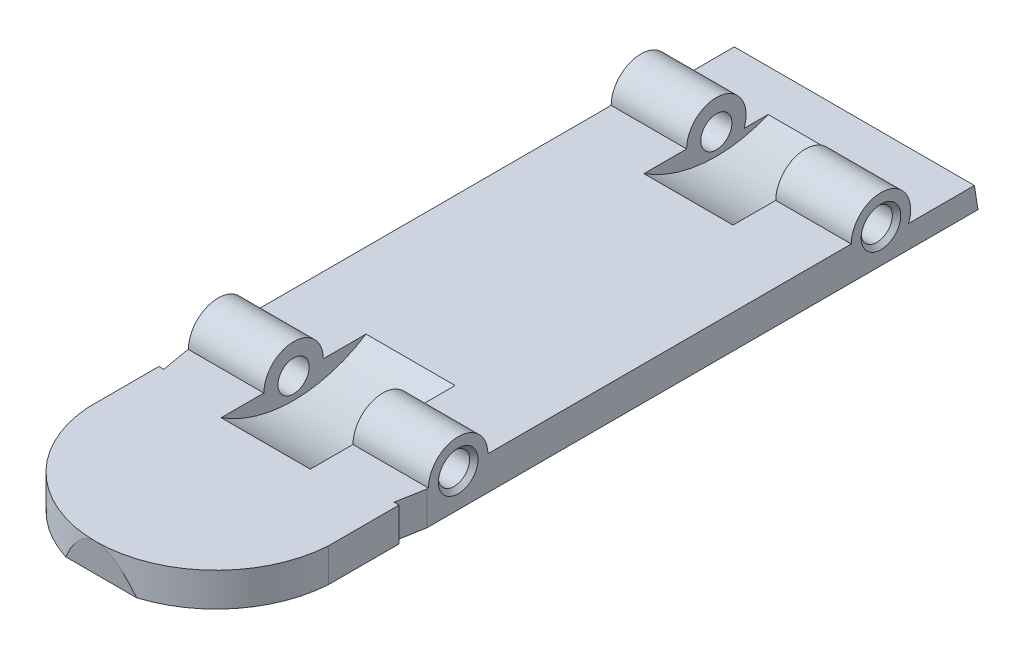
ISO-10303-21;
HEADER;
FILE_DESCRIPTION(('STEP AP214'),'2;1');
FILE_NAME('part.step','',(''),(''),'','','');
FILE_SCHEMA(('AUTOMOTIVE_DESIGN { 1 0 10303 214 1 1 1 1 }'));
ENDSEC;
DATA;
#1=APPLICATION_CONTEXT('core data for automotive mechanical design processes');
#2=APPLICATION_PROTOCOL_DEFINITION('international standard','automotive_design',2000,#1);
#3=PRODUCT_CONTEXT('',#1,'mechanical');
#4=PRODUCT('Part','Part','',(#3));
#5=PRODUCT_RELATED_PRODUCT_CATEGORY('part','',(#4));
#6=PRODUCT_DEFINITION_FORMATION('','',#4);
#7=PRODUCT_DEFINITION_CONTEXT('part definition',#1,'design');
#8=PRODUCT_DEFINITION('design','',#6,#7);
#9=PRODUCT_DEFINITION_SHAPE('','',#8);
#10=(LENGTH_UNIT() NAMED_UNIT(*) SI_UNIT(.MILLI.,.METRE.));
#11=(NAMED_UNIT(*) PLANE_ANGLE_UNIT() SI_UNIT($,.RADIAN.));
#12=(NAMED_UNIT(*) SI_UNIT($,.STERADIAN.) SOLID_ANGLE_UNIT());
#13=UNCERTAINTY_MEASURE_WITH_UNIT(LENGTH_MEASURE(1.E-05),#10,'distance_accuracy_value','');
#14=(GEOMETRIC_REPRESENTATION_CONTEXT(3) GLOBAL_UNCERTAINTY_ASSIGNED_CONTEXT((#13)) GLOBAL_UNIT_ASSIGNED_CONTEXT((#10,
#11,#12)) REPRESENTATION_CONTEXT('',''));
#15=CARTESIAN_POINT('',(0.,0.,0.));
#16=DIRECTION('',(0.,0.,1.));
#17=DIRECTION('',(1.,0.,0.));
#18=AXIS2_PLACEMENT_3D('',#15,#16,#17);
#19=CARTESIAN_POINT('',(6.1595,0.,21.6916));
#20=DIRECTION('',(1.,0.,0.));
#21=DIRECTION('',(0.,0.,-1.));
#22=AXIS2_PLACEMENT_3D('',#19,#20,#21);
#23=PLANE('',#22);
#24=CARTESIAN_POINT('',(6.1595,0.,0.));
#25=DIRECTION('',(-1.,0.,0.));
#26=DIRECTION('',(0.,1.,0.));
#27=AXIS2_PLACEMENT_3D('',#24,#25,#26);
#28=CIRCLE('',#27,1.01611589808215);
#29=CARTESIAN_POINT('',(6.1595,1.01611589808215,0.));
#30=VERTEX_POINT('',#29);
#31=EDGE_CURVE('E787',#30,#30,#28,.T.);
#32=ORIENTED_EDGE('',*,*,#31,.T.);
#33=EDGE_LOOP('',(#32));
#34=FACE_BOUND('',#33,.T.);
#35=CARTESIAN_POINT('',(6.1595,0.,21.6916));
#36=DIRECTION('',(1.,0.,0.));
#37=DIRECTION('',(0.,1.,0.));
#38=AXIS2_PLACEMENT_3D('',#35,#36,#37);
#39=CIRCLE('',#38,1.01611589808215);
#40=CARTESIAN_POINT('',(6.1595,1.01611589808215,21.6916));
#41=VERTEX_POINT('',#40);
#42=EDGE_CURVE('E221',#41,#41,#39,.T.);
#43=ORIENTED_EDGE('',*,*,#42,.F.);
#44=EDGE_LOOP('',(#43));
#45=FACE_BOUND('',#44,.T.);
#46=DIRECTION('',(0.,1.,0.));
#47=VECTOR('',#46,1.);
#48=CARTESIAN_POINT('',(6.1595,0.,23.2874414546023));
#49=LINE('',#48,#47);
#50=CARTESIAN_POINT('',(6.1595,-1.7272,23.2874414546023));
#51=VERTEX_POINT('',#50);
#52=CARTESIAN_POINT('',(6.1595,0.,23.2874414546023));
#53=VERTEX_POINT('',#52);
#54=EDGE_CURVE('E398',#51,#53,#49,.T.);
#55=ORIENTED_EDGE('',*,*,#54,.F.);
#56=DIRECTION('',(0.,0.,-1.));
#57=VECTOR('',#56,1.);
#58=CARTESIAN_POINT('',(6.1595,-1.7272,33.8523854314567));
#59=LINE('',#58,#57);
#60=CARTESIAN_POINT('',(6.1595,-1.7272,-4.97970200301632));
#61=VERTEX_POINT('',#60);
#62=EDGE_CURVE('E329',#51,#61,#59,.T.);
#63=ORIENTED_EDGE('',*,*,#62,.T.);
#64=DIRECTION('',(0.,0.987688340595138,0.156434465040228));
#65=VECTOR('',#64,1.);
#66=CARTESIAN_POINT('',(6.1595,0.,-4.70614039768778));
#67=LINE('',#66,#65);
#68=CARTESIAN_POINT('',(6.1595,-0.5588,-4.79464562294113));
#69=VERTEX_POINT('',#68);
#70=EDGE_CURVE('E334',#61,#69,#67,.T.);
#71=ORIENTED_EDGE('',*,*,#70,.T.);
#72=DIRECTION('',(0.,0.,-1.));
#73=VECTOR('',#72,1.);
#74=CARTESIAN_POINT('',(6.1595,-0.5588,-4.79464562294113));
#75=LINE('',#74,#73);
#76=CARTESIAN_POINT('',(6.1595,-0.5588,-1.41785703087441));
#77=VERTEX_POINT('',#76);
#78=EDGE_CURVE('E313',#77,#69,#75,.T.);
#79=ORIENTED_EDGE('',*,*,#78,.F.);
#80=CARTESIAN_POINT('',(6.1595,0.,0.));
#81=DIRECTION('',(1.,0.,0.));
#82=DIRECTION('',(0.,0.,-1.));
#83=AXIS2_PLACEMENT_3D('',#80,#81,#82);
#84=CIRCLE('',#83,1.524);
#85=CARTESIAN_POINT('',(6.1595,0.,1.524));
#86=VERTEX_POINT('',#85);
#87=EDGE_CURVE('E337',#77,#86,#84,.T.);
#88=ORIENTED_EDGE('',*,*,#87,.T.);
#89=DIRECTION('',(0.,0.,1.));
#90=VECTOR('',#89,1.);
#91=CARTESIAN_POINT('',(6.1595,0.,20.1676));
#92=LINE('',#91,#90);
#93=CARTESIAN_POINT('',(6.1595,0.,20.1676));
#94=VERTEX_POINT('',#93);
#95=EDGE_CURVE('E339',#86,#94,#92,.T.);
#96=ORIENTED_EDGE('',*,*,#95,.T.);
#97=CARTESIAN_POINT('',(6.1595,0.,21.6916));
#98=DIRECTION('',(1.,0.,0.));
#99=DIRECTION('',(0.,0.,-1.));
#100=AXIS2_PLACEMENT_3D('',#97,#98,#99);
#101=CIRCLE('',#100,1.524);
#102=CARTESIAN_POINT('',(6.1595,0.,23.2156));
#103=VERTEX_POINT('',#102);
#104=EDGE_CURVE('E341',#94,#103,#101,.T.);
#105=ORIENTED_EDGE('',*,*,#104,.T.);
#106=DIRECTION('',(0.,0.,1.));
#107=VECTOR('',#106,1.);
#108=CARTESIAN_POINT('',(6.1595,0.,34.1259470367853));
#109=LINE('',#108,#107);
#110=EDGE_CURVE('E326',#103,#53,#109,.T.);
#111=ORIENTED_EDGE('',*,*,#110,.T.);
#112=EDGE_LOOP('',(#55,#63,#71,#79,#88,#96,#105,#111));
#113=FACE_BOUND('',#112,.T.);
#114=ADVANCED_FACE('F52',(#34,#45,#113),#23,.T.);
#115=CARTESIAN_POINT('',(-6.1595,0.,21.6916));
#116=DIRECTION('',(1.,0.,0.));
#117=DIRECTION('',(0.,0.,-1.));
#118=AXIS2_PLACEMENT_3D('',#115,#116,#117);
#119=PLANE('',#118);
#120=CARTESIAN_POINT('',(-6.1595,0.,0.));
#121=DIRECTION('',(-1.,0.,0.));
#122=DIRECTION('',(0.,1.,0.));
#123=AXIS2_PLACEMENT_3D('',#120,#121,#122);
#124=CIRCLE('',#123,1.01611589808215);
#125=CARTESIAN_POINT('',(-6.1595,1.01611589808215,0.));
#126=VERTEX_POINT('',#125);
#127=EDGE_CURVE('E792',#126,#126,#124,.T.);
#128=ORIENTED_EDGE('',*,*,#127,.F.);
#129=EDGE_LOOP('',(#128));
#130=FACE_BOUND('',#129,.T.);
#131=CARTESIAN_POINT('',(-6.1595,0.,21.6916));
#132=DIRECTION('',(1.,0.,0.));
#133=DIRECTION('',(0.,1.,0.));
#134=AXIS2_PLACEMENT_3D('',#131,#132,#133);
#135=CIRCLE('',#134,1.01611589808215);
#136=CARTESIAN_POINT('',(-6.1595,1.01611589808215,21.6916));
#137=VERTEX_POINT('',#136);
#138=EDGE_CURVE('E779',#137,#137,#135,.T.);
#139=ORIENTED_EDGE('',*,*,#138,.T.);
#140=EDGE_LOOP('',(#139));
#141=FACE_BOUND('',#140,.T.);
#142=DIRECTION('',(0.,0.,-1.));
#143=VECTOR('',#142,1.);
#144=CARTESIAN_POINT('',(-6.1595,-1.7272,33.8523854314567));
#145=LINE('',#144,#143);
#146=CARTESIAN_POINT('',(-6.1595,-1.7272,23.2874414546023));
#147=VERTEX_POINT('',#146);
#148=CARTESIAN_POINT('',(-6.1595,-1.7272,-4.97970200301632));
#149=VERTEX_POINT('',#148);
#150=EDGE_CURVE('E347',#147,#149,#145,.T.);
#151=ORIENTED_EDGE('',*,*,#150,.F.);
#152=DIRECTION('',(0.,1.,0.));
#153=VECTOR('',#152,1.);
#154=CARTESIAN_POINT('',(-6.1595,0.,23.2874414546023));
#155=LINE('',#154,#153);
#156=CARTESIAN_POINT('',(-6.1595,0.,23.2874414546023));
#157=VERTEX_POINT('',#156);
#158=EDGE_CURVE('E12',#147,#157,#155,.T.);
#159=ORIENTED_EDGE('',*,*,#158,.T.);
#160=DIRECTION('',(0.,0.,1.));
#161=VECTOR('',#160,1.);
#162=CARTESIAN_POINT('',(-6.1595,0.,34.1259470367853));
#163=LINE('',#162,#161);
#164=CARTESIAN_POINT('',(-6.1595,0.,23.2156));
#165=VERTEX_POINT('',#164);
#166=EDGE_CURVE('E344',#165,#157,#163,.T.);
#167=ORIENTED_EDGE('',*,*,#166,.F.);
#168=CARTESIAN_POINT('',(-6.1595,0.,21.6916));
#169=DIRECTION('',(1.,0.,0.));
#170=DIRECTION('',(0.,0.,-1.));
#171=AXIS2_PLACEMENT_3D('',#168,#169,#170);
#172=CIRCLE('',#171,1.524);
#173=CARTESIAN_POINT('',(-6.1595,0.,20.1676));
#174=VERTEX_POINT('',#173);
#175=EDGE_CURVE('E358',#174,#165,#172,.T.);
#176=ORIENTED_EDGE('',*,*,#175,.F.);
#177=DIRECTION('',(0.,0.,1.));
#178=VECTOR('',#177,1.);
#179=CARTESIAN_POINT('',(-6.1595,0.,20.1676));
#180=LINE('',#179,#178);
#181=CARTESIAN_POINT('',(-6.1595,0.,1.524));
#182=VERTEX_POINT('',#181);
#183=EDGE_CURVE('E355',#182,#174,#180,.T.);
#184=ORIENTED_EDGE('',*,*,#183,.F.);
#185=CARTESIAN_POINT('',(-6.1595,0.,0.));
#186=DIRECTION('',(1.,0.,0.));
#187=DIRECTION('',(0.,0.,-1.));
#188=AXIS2_PLACEMENT_3D('',#185,#186,#187);
#189=CIRCLE('',#188,1.524);
#190=CARTESIAN_POINT('',(-6.1595,-0.5588,-1.41785703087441));
#191=VERTEX_POINT('',#190);
#192=EDGE_CURVE('E352',#191,#182,#189,.T.);
#193=ORIENTED_EDGE('',*,*,#192,.F.);
#194=DIRECTION('',(0.,0.,-1.));
#195=VECTOR('',#194,1.);
#196=CARTESIAN_POINT('',(-6.1595,-0.5588,-4.79464562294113));
#197=LINE('',#196,#195);
#198=CARTESIAN_POINT('',(-6.1595,-0.5588,-4.79464562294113));
#199=VERTEX_POINT('',#198);
#200=EDGE_CURVE('E314',#191,#199,#197,.T.);
#201=ORIENTED_EDGE('',*,*,#200,.T.);
#202=DIRECTION('',(0.,0.987688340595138,0.156434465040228));
#203=VECTOR('',#202,1.);
#204=CARTESIAN_POINT('',(-6.1595,0.,-4.70614039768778));
#205=LINE('',#204,#203);
#206=EDGE_CURVE('E349',#149,#199,#205,.T.);
#207=ORIENTED_EDGE('',*,*,#206,.F.);
#208=EDGE_LOOP('',(#151,#159,#167,#176,#184,#193,#201,#207));
#209=FACE_BOUND('',#208,.T.);
#210=ADVANCED_FACE('F408',(#130,#141,#209),#119,.F.);
#211=DIRECTION('',(0.,-1.,0.));
#212=VECTOR('',#211,1.);
#213=CARTESIAN_POINT('',(6.1595,0.,24.7279470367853));
#214=LINE('',#213,#212);
#215=CARTESIAN_POINT('',(6.1595,0.,24.7279470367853));
#216=VERTEX_POINT('',#215);
#217=CARTESIAN_POINT('',(6.1595,-1.7272,24.7279470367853));
#218=VERTEX_POINT('',#217);
#219=EDGE_CURVE('E400',#216,#218,#214,.T.);
#220=ORIENTED_EDGE('',*,*,#219,.F.);
#221=CARTESIAN_POINT('',(6.1595,0.,28.3494901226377));
#222=VERTEX_POINT('',#221);
#223=EDGE_CURVE('E330',#216,#222,#109,.T.);
#224=ORIENTED_EDGE('',*,*,#223,.T.);
#225=DIRECTION('',(0.,1.,0.));
#226=VECTOR('',#225,1.);
#227=CARTESIAN_POINT('',(6.1595,-12.319,28.3494901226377));
#228=LINE('',#227,#226);
#229=CARTESIAN_POINT('',(6.1595,-1.7272,28.3494901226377));
#230=VERTEX_POINT('',#229);
#231=EDGE_CURVE('E380',#222,#230,#228,.F.);
#232=ORIENTED_EDGE('',*,*,#231,.T.);
#233=EDGE_CURVE('E331',#230,#218,#59,.T.);
#234=ORIENTED_EDGE('',*,*,#233,.T.);
#235=EDGE_LOOP('',(#220,#224,#232,#234));
#236=FACE_BOUND('',#235,.T.);
#237=ADVANCED_FACE('F425',(#236),#23,.T.);
#238=CARTESIAN_POINT('',(6.1595,0.,20.1676));
#239=DIRECTION('',(0.,-1.,0.));
#240=DIRECTION('',(0.,0.,-1.));
#241=AXIS2_PLACEMENT_3D('',#238,#239,#240);
#242=PLANE('',#241);
#243=DIRECTION('',(0.,0.,1.));
#244=VECTOR('',#243,1.);
#245=CARTESIAN_POINT('',(-2.286,0.,20.1676));
#246=LINE('',#245,#244);
#247=CARTESIAN_POINT('',(-2.286,0.,1.524));
#248=VERTEX_POINT('',#247);
#249=CARTESIAN_POINT('',(-2.286,0.,3.71676625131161));
#250=VERTEX_POINT('',#249);
#251=EDGE_CURVE('E263',#248,#250,#246,.T.);
#252=ORIENTED_EDGE('',*,*,#251,.F.);
#253=DIRECTION('',(-1.,0.,0.));
#254=VECTOR('',#253,1.);
#255=CARTESIAN_POINT('',(6.1595,0.,1.524));
#256=LINE('',#255,#254);
#257=EDGE_CURVE('E368',#248,#182,#256,.T.);
#258=ORIENTED_EDGE('',*,*,#257,.T.);
#259=ORIENTED_EDGE('',*,*,#183,.T.);
#260=DIRECTION('',(-1.,0.,0.));
#261=VECTOR('',#260,1.);
#262=CARTESIAN_POINT('',(6.1595,0.,20.1676));
#263=LINE('',#262,#261);
#264=CARTESIAN_POINT('',(-2.286,0.,20.1676));
#265=VERTEX_POINT('',#264);
#266=EDGE_CURVE('E364',#265,#174,#263,.T.);
#267=ORIENTED_EDGE('',*,*,#266,.F.);
#268=DIRECTION('',(0.,0.,1.));
#269=VECTOR('',#268,1.);
#270=CARTESIAN_POINT('',(-2.286,0.,20.1676));
#271=LINE('',#270,#269);
#272=CARTESIAN_POINT('',(-2.286,0.,17.9748337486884));
#273=VERTEX_POINT('',#272);
#274=EDGE_CURVE('E290',#273,#265,#271,.T.);
#275=ORIENTED_EDGE('',*,*,#274,.F.);
#276=DIRECTION('',(1.,0.,0.));
#277=VECTOR('',#276,1.);
#278=CARTESIAN_POINT('',(-2.286,0.,17.9748337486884));
#279=LINE('',#278,#277);
#280=CARTESIAN_POINT('',(2.286,0.,17.9748337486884));
#281=VERTEX_POINT('',#280);
#282=EDGE_CURVE('E383',#273,#281,#279,.T.);
#283=ORIENTED_EDGE('',*,*,#282,.T.);
#284=DIRECTION('',(0.,0.,1.));
#285=VECTOR('',#284,1.);
#286=CARTESIAN_POINT('',(2.286,0.,20.1676));
#287=LINE('',#286,#285);
#288=CARTESIAN_POINT('',(2.286,0.,20.1676));
#289=VERTEX_POINT('',#288);
#290=EDGE_CURVE('E281',#281,#289,#287,.T.);
#291=ORIENTED_EDGE('',*,*,#290,.T.);
#292=EDGE_CURVE('E365',#94,#289,#263,.T.);
#293=ORIENTED_EDGE('',*,*,#292,.F.);
#294=ORIENTED_EDGE('',*,*,#95,.F.);
#295=CARTESIAN_POINT('',(2.286,0.,1.524));
#296=VERTEX_POINT('',#295);
#297=EDGE_CURVE('E369',#86,#296,#256,.T.);
#298=ORIENTED_EDGE('',*,*,#297,.T.);
#299=DIRECTION('',(0.,0.,1.));
#300=VECTOR('',#299,1.);
#301=CARTESIAN_POINT('',(2.286,0.,20.1676));
#302=LINE('',#301,#300);
#303=CARTESIAN_POINT('',(2.286,0.,3.71676625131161));
#304=VERTEX_POINT('',#303);
#305=EDGE_CURVE('E255',#296,#304,#302,.T.);
#306=ORIENTED_EDGE('',*,*,#305,.T.);
#307=DIRECTION('',(1.,0.,0.));
#308=VECTOR('',#307,1.);
#309=CARTESIAN_POINT('',(-2.286,0.,3.71676625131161));
#310=LINE('',#309,#308);
#311=EDGE_CURVE('E268',#304,#250,#310,.F.);
#312=ORIENTED_EDGE('',*,*,#311,.T.);
#313=EDGE_LOOP('',(#252,#258,#259,#267,#275,#283,#291,#293,#294,#298,#306,#312));
#314=FACE_BOUND('',#313,.T.);
#315=ADVANCED_FACE('F460',(#314),#242,.F.);
#316=CARTESIAN_POINT('',(6.1595,0.,0.));
#317=DIRECTION('',(-1.,0.,0.));
#318=DIRECTION('',(0.,0.,1.));
#319=AXIS2_PLACEMENT_3D('',#316,#317,#318);
#320=CYLINDRICAL_SURFACE('',#319,1.524);
#321=CARTESIAN_POINT('',(-2.286,0.,0.));
#322=DIRECTION('',(1.,0.,0.));
#323=DIRECTION('',(0.,0.,-1.));
#324=AXIS2_PLACEMENT_3D('',#321,#322,#323);
#325=CIRCLE('',#324,1.524);
#326=CARTESIAN_POINT('',(-2.286,-0.558800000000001,-1.41785703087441));
#327=VERTEX_POINT('',#326);
#328=EDGE_CURVE('E261',#327,#248,#325,.T.);
#329=ORIENTED_EDGE('',*,*,#328,.F.);
#330=DIRECTION('',(1.,0.,0.));
#331=VECTOR('',#330,1.);
#332=CARTESIAN_POINT('',(-6.1595,-0.5588,-1.41785703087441));
#333=LINE('',#332,#331);
#334=EDGE_CURVE('E323',#191,#327,#333,.T.);
#335=ORIENTED_EDGE('',*,*,#334,.F.);
#336=ORIENTED_EDGE('',*,*,#192,.T.);
#337=ORIENTED_EDGE('',*,*,#257,.F.);
#338=EDGE_LOOP('',(#329,#335,#336,#337));
#339=FACE_BOUND('',#338,.T.);
#340=ADVANCED_FACE('F464',(#339),#320,.T.);
#341=CARTESIAN_POINT('',(6.1595,0.,0.));
#342=DIRECTION('',(-1.,0.,0.));
#343=DIRECTION('',(0.,0.,1.));
#344=AXIS2_PLACEMENT_3D('',#341,#342,#343);
#345=CYLINDRICAL_SURFACE('',#344,0.8001);
#346=CARTESIAN_POINT('',(-5.94348410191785,0.,0.));
#347=DIRECTION('',(-1.,0.,0.));
#348=DIRECTION('',(0.,1.,0.));
#349=AXIS2_PLACEMENT_3D('',#346,#347,#348);
#350=CIRCLE('',#349,0.800100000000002);
#351=CARTESIAN_POINT('',(-5.94348410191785,0.,0.8001));
#352=VERTEX_POINT('',#351);
#353=EDGE_CURVE('E795',#352,#352,#350,.T.);
#354=CARTESIAN_POINT('',(-2.286,0.,0.));
#355=DIRECTION('',(1.,0.,0.));
#356=DIRECTION('',(0.,0.,-1.));
#357=AXIS2_PLACEMENT_3D('',#354,#355,#356);
#358=CIRCLE('',#357,0.8001);
#359=CARTESIAN_POINT('',(-2.286,0.,0.8001));
#360=VERTEX_POINT('',#359);
#361=EDGE_CURVE('E265',#360,#360,#358,.T.);
#362=CARTESIAN_POINT('',(-5.94348410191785,0.,0.8001));
#363=CARTESIAN_POINT('',(-5.90538530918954,0.,0.8001));
#364=CARTESIAN_POINT('',(-5.86728651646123,0.,0.8001));
#365=CARTESIAN_POINT('',(-5.79108893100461,0.,0.8001));
#366=CARTESIAN_POINT('',(-5.7529901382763,0.,0.8001));
#367=CARTESIAN_POINT('',(-5.67679255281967,0.,0.8001));
#368=CARTESIAN_POINT('',(-5.63869376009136,0.,0.8001));
#369=CARTESIAN_POINT('',(-5.56249617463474,0.,0.8001));
#370=CARTESIAN_POINT('',(-5.52439738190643,0.,0.8001));
#371=CARTESIAN_POINT('',(-5.44819979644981,0.,0.8001));
#372=CARTESIAN_POINT('',(-5.4101010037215,0.,0.8001));
#373=CARTESIAN_POINT('',(-5.33390341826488,0.,0.8001));
#374=CARTESIAN_POINT('',(-5.29580462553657,0.,0.8001));
#375=CARTESIAN_POINT('',(-5.21960704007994,0.,0.8001));
#376=CARTESIAN_POINT('',(-5.18150824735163,0.,0.8001));
#377=CARTESIAN_POINT('',(-5.10531066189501,0.,0.8001));
#378=CARTESIAN_POINT('',(-5.0672118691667,0.,0.8001));
#379=CARTESIAN_POINT('',(-4.99101428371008,0.,0.8001));
#380=CARTESIAN_POINT('',(-4.95291549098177,0.,0.8001));
#381=CARTESIAN_POINT('',(-4.87671790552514,0.,0.8001));
#382=CARTESIAN_POINT('',(-4.83861911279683,0.,0.8001));
#383=CARTESIAN_POINT('',(-4.76242152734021,0.,0.8001));
#384=CARTESIAN_POINT('',(-4.7243227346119,0.,0.8001));
#385=CARTESIAN_POINT('',(-4.64812514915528,0.,0.8001));
#386=CARTESIAN_POINT('',(-4.61002635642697,0.,0.8001));
#387=CARTESIAN_POINT('',(-4.53382877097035,0.,0.8001));
#388=CARTESIAN_POINT('',(-4.49572997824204,0.,0.8001));
#389=CARTESIAN_POINT('',(-4.41953239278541,0.,0.8001));
#390=CARTESIAN_POINT('',(-4.3814336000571,0.,0.8001));
#391=CARTESIAN_POINT('',(-4.30523601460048,0.,0.8001));
#392=CARTESIAN_POINT('',(-4.26713722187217,0.,0.8001));
#393=CARTESIAN_POINT('',(-4.19093963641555,0.,0.8001));
#394=CARTESIAN_POINT('',(-4.15284084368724,0.,0.8001));
#395=CARTESIAN_POINT('',(-4.07664325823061,0.,0.8001));
#396=CARTESIAN_POINT('',(-4.0385444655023,0.,0.8001));
#397=CARTESIAN_POINT('',(-3.96234688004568,0.,0.8001));
#398=CARTESIAN_POINT('',(-3.92424808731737,0.,0.8001));
#399=CARTESIAN_POINT('',(-3.84805050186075,0.,0.8001));
#400=CARTESIAN_POINT('',(-3.80995170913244,0.,0.8001));
#401=CARTESIAN_POINT('',(-3.73375412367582,0.,0.8001));
#402=CARTESIAN_POINT('',(-3.6956553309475,0.,0.8001));
#403=CARTESIAN_POINT('',(-3.61945774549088,0.,0.8001));
#404=CARTESIAN_POINT('',(-3.58135895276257,0.,0.8001));
#405=CARTESIAN_POINT('',(-3.50516136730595,0.,0.8001));
#406=CARTESIAN_POINT('',(-3.46706257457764,0.,0.8001));
#407=CARTESIAN_POINT('',(-3.39086498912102,0.,0.8001));
#408=CARTESIAN_POINT('',(-3.35276619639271,0.,0.8001));
#409=CARTESIAN_POINT('',(-3.27656861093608,0.,0.8001));
#410=CARTESIAN_POINT('',(-3.23846981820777,0.,0.8001));
#411=CARTESIAN_POINT('',(-3.16227223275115,0.,0.8001));
#412=CARTESIAN_POINT('',(-3.12417344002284,0.,0.8001));
#413=CARTESIAN_POINT('',(-3.04797585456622,0.,0.8001));
#414=CARTESIAN_POINT('',(-3.00987706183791,0.,0.8001));
#415=CARTESIAN_POINT('',(-2.93367947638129,0.,0.8001));
#416=CARTESIAN_POINT('',(-2.89558068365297,0.,0.8001));
#417=CARTESIAN_POINT('',(-2.81938309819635,0.,0.8001));
#418=CARTESIAN_POINT('',(-2.78128430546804,0.,0.8001));
#419=CARTESIAN_POINT('',(-2.70508672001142,0.,0.8001));
#420=CARTESIAN_POINT('',(-2.66698792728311,0.,0.8001));
#421=CARTESIAN_POINT('',(-2.59079034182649,0.,0.8001));
#422=CARTESIAN_POINT('',(-2.55269154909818,0.,0.8001));
#423=CARTESIAN_POINT('',(-2.47649396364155,0.,0.8001));
#424=CARTESIAN_POINT('',(-2.43839517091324,0.,0.8001));
#425=CARTESIAN_POINT('',(-2.36219758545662,0.,0.8001));
#426=CARTESIAN_POINT('',(-2.32409879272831,0.,0.8001));
#427=CARTESIAN_POINT('',(-2.286,0.,0.8001));
#428=B_SPLINE_CURVE_WITH_KNOTS('',3,(#362,#363,#364,#365,#366,#367,#368,#369,#370,#371,#372,
#373,#374,#375,#376,#377,#378,#379,#380,#381,#382,#383,#384,#385,#386,#387,#388,#389,#390,#391,
#392,#393,#394,#395,#396,#397,#398,#399,#400,#401,#402,#403,#404,#405,#406,#407,#408,#409,#410,
#411,#412,#413,#414,#415,#416,#417,#418,#419,#420,#421,#422,#423,#424,#425,#426,#427),
.UNSPECIFIED.,.F.,.F.,(4,2,2,2,2,2,2,2,2,2,2,2,2,2,2,2,2,2,2,2,2,2,2,2,2,2,2,2,2,2,2,2,4),(0.,
0.114296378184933,0.228592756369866,0.342889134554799,0.457185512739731,0.571481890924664,
0.685778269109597,0.80007464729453,0.914371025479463,1.0286674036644,1.14296378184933,
1.25726016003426,1.37155653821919,1.48585291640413,1.60014929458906,1.71444567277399,
1.82874205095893,1.94303842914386,2.05733480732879,2.17163118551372,2.28592756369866,
2.40022394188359,2.51452032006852,2.62881669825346,2.74311307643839,2.85740945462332,
2.97170583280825,3.08600221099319,3.20029858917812,3.31459496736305,3.42889134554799,
3.54318772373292,3.65748410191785),.UNSPECIFIED.);
#429=EDGE_CURVE('BSEAM470',#352,#360,#428,.T.);
#430=ORIENTED_EDGE('',*,*,#353,.T.);
#431=ORIENTED_EDGE('',*,*,#361,.T.);
#432=ORIENTED_EDGE('',*,*,#429,.T.);
#433=ORIENTED_EDGE('',*,*,#429,.F.);
#434=EDGE_LOOP('',(#430,#432,#431,#433));
#435=FACE_BOUND('',#434,.T.);
#436=ADVANCED_FACE('F470',(#435),#345,.F.);
#437=CARTESIAN_POINT('',(-6.1595,-0.5588,-4.79464562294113));
#438=DIRECTION('',(0.,-1.,0.));
#439=DIRECTION('',(0.,0.,-1.));
#440=AXIS2_PLACEMENT_3D('',#437,#438,#439);
#441=PLANE('',#440);
#442=DIRECTION('',(0.,0.,1.));
#443=VECTOR('',#442,1.);
#444=CARTESIAN_POINT('',(-2.286,-0.5588,-4.79464562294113));
#445=LINE('',#444,#443);
#446=CARTESIAN_POINT('',(-2.286,-0.558800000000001,-2.65721996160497));
#447=VERTEX_POINT('',#446);
#448=EDGE_CURVE('E396',#447,#327,#445,.T.);
#449=ORIENTED_EDGE('',*,*,#448,.F.);
#450=DIRECTION('',(1.,0.,0.));
#451=VECTOR('',#450,1.);
#452=CARTESIAN_POINT('',(-2.286,-0.558799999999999,-2.65721996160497));
#453=LINE('',#452,#451);
#454=CARTESIAN_POINT('',(2.286,-0.558800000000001,-2.65721996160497));
#455=VERTEX_POINT('',#454);
#456=EDGE_CURVE('E393',#447,#455,#453,.T.);
#457=ORIENTED_EDGE('',*,*,#456,.T.);
#458=DIRECTION('',(0.,0.,1.));
#459=VECTOR('',#458,1.);
#460=CARTESIAN_POINT('',(2.286,-0.5588,-4.79464562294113));
#461=LINE('',#460,#459);
#462=CARTESIAN_POINT('',(2.286,-0.5588,-1.41785703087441));
#463=VERTEX_POINT('',#462);
#464=EDGE_CURVE('E390',#455,#463,#461,.T.);
#465=ORIENTED_EDGE('',*,*,#464,.T.);
#466=EDGE_CURVE('E317',#463,#77,#333,.T.);
#467=ORIENTED_EDGE('',*,*,#466,.T.);
#468=ORIENTED_EDGE('',*,*,#78,.T.);
#469=DIRECTION('',(1.,0.,0.));
#470=VECTOR('',#469,1.);
#471=CARTESIAN_POINT('',(-6.1595,-0.5588,-4.79464562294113));
#472=LINE('',#471,#470);
#473=EDGE_CURVE('E319',#199,#69,#472,.T.);
#474=ORIENTED_EDGE('',*,*,#473,.F.);
#475=ORIENTED_EDGE('',*,*,#200,.F.);
#476=ORIENTED_EDGE('',*,*,#334,.T.);
#477=EDGE_LOOP('',(#449,#457,#465,#467,#468,#474,#475,#476));
#478=FACE_BOUND('',#477,.T.);
#479=ADVANCED_FACE('F500',(#478),#441,.F.);
#480=CARTESIAN_POINT('',(6.1595,0.,34.1259470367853));
#481=DIRECTION('',(0.,-1.,0.));
#482=DIRECTION('',(0.,0.,-1.));
#483=AXIS2_PLACEMENT_3D('',#480,#481,#482);
#484=PLANE('',#483);
#485=ORIENTED_EDGE('',*,*,#166,.T.);
#486=DIRECTION('',(0.173648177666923,0.,0.984807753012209));
#487=VECTOR('',#486,1.);
#488=CARTESIAN_POINT('',(-3.93454308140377,0.,35.9057991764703));
#489=LINE('',#488,#487);
#490=CARTESIAN_POINT('',(-5.9055,0.,24.7279470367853));
#491=VERTEX_POINT('',#490);
#492=EDGE_CURVE('E232',#157,#491,#489,.T.);
#493=ORIENTED_EDGE('',*,*,#492,.T.);
#494=DIRECTION('',(-1.,0.,0.));
#495=VECTOR('',#494,1.);
#496=CARTESIAN_POINT('',(6.1595,0.,24.7279470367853));
#497=LINE('',#496,#495);
#498=CARTESIAN_POINT('',(-6.1595,0.,24.7279470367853));
#499=VERTEX_POINT('',#498);
#500=EDGE_CURVE('E212',#491,#499,#497,.T.);
#501=ORIENTED_EDGE('',*,*,#500,.T.);
#502=CARTESIAN_POINT('',(-6.1595,0.,28.3494901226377));
#503=VERTEX_POINT('',#502);
#504=EDGE_CURVE('E322',#499,#503,#163,.T.);
#505=ORIENTED_EDGE('',*,*,#504,.T.);
#506=CARTESIAN_POINT('',(0.,0.,27.9537470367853));
#507=DIRECTION('',(0.,1.,0.));
#508=DIRECTION('',(0.,0.,1.));
#509=AXIS2_PLACEMENT_3D('',#506,#507,#508);
#510=CIRCLE('',#509,6.1722);
#511=CARTESIAN_POINT('',(0.,0.,34.1259470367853));
#512=VERTEX_POINT('',#511);
#513=EDGE_CURVE('E304',#503,#512,#510,.T.);
#514=ORIENTED_EDGE('',*,*,#513,.T.);
#515=CARTESIAN_POINT('',(0.,0.,27.9537470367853));
#516=DIRECTION('',(0.,1.,0.));
#517=DIRECTION('',(0.,0.,1.));
#518=AXIS2_PLACEMENT_3D('',#515,#516,#517);
#519=CIRCLE('',#518,6.1722);
#520=EDGE_CURVE('E297',#512,#222,#519,.T.);
#521=ORIENTED_EDGE('',*,*,#520,.T.);
#522=ORIENTED_EDGE('',*,*,#223,.F.);
#523=DIRECTION('',(-1.,0.,0.));
#524=VECTOR('',#523,1.);
#525=CARTESIAN_POINT('',(6.1595,0.,24.7279470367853));
#526=LINE('',#525,#524);
#527=CARTESIAN_POINT('',(5.9055,0.,24.7279470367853));
#528=VERTEX_POINT('',#527);
#529=EDGE_CURVE('E243',#216,#528,#526,.T.);
#530=ORIENTED_EDGE('',*,*,#529,.T.);
#531=DIRECTION('',(0.173648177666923,0.,-0.984807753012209));
#532=VECTOR('',#531,1.);
#533=CARTESIAN_POINT('',(4.30600638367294,0.,33.7991261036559));
#534=LINE('',#533,#532);
#535=EDGE_CURVE('E240',#528,#53,#534,.T.);
#536=ORIENTED_EDGE('',*,*,#535,.T.);
#537=ORIENTED_EDGE('',*,*,#110,.F.);
#538=DIRECTION('',(-1.,0.,0.));
#539=VECTOR('',#538,1.);
#540=CARTESIAN_POINT('',(6.1595,0.,23.2156));
#541=LINE('',#540,#539);
#542=CARTESIAN_POINT('',(2.286,0.,23.2156));
#543=VERTEX_POINT('',#542);
#544=EDGE_CURVE('E361',#103,#543,#541,.T.);
#545=ORIENTED_EDGE('',*,*,#544,.T.);
#546=DIRECTION('',(0.,0.,1.));
#547=VECTOR('',#546,1.);
#548=CARTESIAN_POINT('',(2.286,0.,34.1259470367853));
#549=LINE('',#548,#547);
#550=CARTESIAN_POINT('',(2.286,0.,25.4083662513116));
#551=VERTEX_POINT('',#550);
#552=EDGE_CURVE('E284',#543,#551,#549,.T.);
#553=ORIENTED_EDGE('',*,*,#552,.T.);
#554=DIRECTION('',(1.,0.,0.));
#555=VECTOR('',#554,1.);
#556=CARTESIAN_POINT('',(-2.286,0.,25.4083662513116));
#557=LINE('',#556,#555);
#558=CARTESIAN_POINT('',(-2.286,0.,25.4083662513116));
#559=VERTEX_POINT('',#558);
#560=EDGE_CURVE('E294',#551,#559,#557,.F.);
#561=ORIENTED_EDGE('',*,*,#560,.T.);
#562=DIRECTION('',(0.,0.,1.));
#563=VECTOR('',#562,1.);
#564=CARTESIAN_POINT('',(-2.286,0.,34.1259470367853));
#565=LINE('',#564,#563);
#566=CARTESIAN_POINT('',(-2.286,0.,23.2156));
#567=VERTEX_POINT('',#566);
#568=EDGE_CURVE('E292',#567,#559,#565,.T.);
#569=ORIENTED_EDGE('',*,*,#568,.F.);
#570=EDGE_CURVE('E343',#567,#165,#541,.T.);
#571=ORIENTED_EDGE('',*,*,#570,.T.);
#572=EDGE_LOOP('',(#485,#493,#501,#505,#514,#521,#522,#530,#536,#537,#545,#553,#561,#569,#571));
#573=FACE_BOUND('',#572,.T.);
#574=ADVANCED_FACE('F54',(#573),#484,.F.);
#575=CARTESIAN_POINT('',(6.1595,0.,21.6916));
#576=DIRECTION('',(-1.,0.,0.));
#577=DIRECTION('',(0.,0.,1.));
#578=AXIS2_PLACEMENT_3D('',#575,#576,#577);
#579=CYLINDRICAL_SURFACE('',#578,1.524);
#580=CARTESIAN_POINT('',(-2.286,0.,21.6916));
#581=DIRECTION('',(1.,0.,0.));
#582=DIRECTION('',(0.,0.,-1.));
#583=AXIS2_PLACEMENT_3D('',#580,#581,#582);
#584=CIRCLE('',#583,1.524);
#585=EDGE_CURVE('E288',#265,#567,#584,.T.);
#586=ORIENTED_EDGE('',*,*,#585,.F.);
#587=ORIENTED_EDGE('',*,*,#266,.T.);
#588=ORIENTED_EDGE('',*,*,#175,.T.);
#589=ORIENTED_EDGE('',*,*,#570,.F.);
#590=EDGE_LOOP('',(#586,#587,#588,#589));
#591=FACE_BOUND('',#590,.T.);
#592=ADVANCED_FACE('F444',(#591),#579,.T.);
#593=CARTESIAN_POINT('',(6.1595,0.,21.6916));
#594=DIRECTION('',(-1.,0.,0.));
#595=DIRECTION('',(0.,0.,1.));
#596=AXIS2_PLACEMENT_3D('',#593,#594,#595);
#597=CYLINDRICAL_SURFACE('',#596,0.800099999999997);
#598=CARTESIAN_POINT('',(-5.94348410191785,0.,21.6916));
#599=DIRECTION('',(1.,0.,0.));
#600=DIRECTION('',(0.,1.,0.));
#601=AXIS2_PLACEMENT_3D('',#598,#599,#600);
#602=CIRCLE('',#601,0.800100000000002);
#603=CARTESIAN_POINT('',(-5.94348410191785,0.,22.4917));
#604=VERTEX_POINT('',#603);
#605=EDGE_CURVE('E784',#604,#604,#602,.T.);
#606=CARTESIAN_POINT('',(-2.286,0.,21.6916));
#607=DIRECTION('',(1.,0.,0.));
#608=DIRECTION('',(0.,0.,-1.));
#609=AXIS2_PLACEMENT_3D('',#606,#607,#608);
#610=CIRCLE('',#609,0.800099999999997);
#611=CARTESIAN_POINT('',(-2.286,0.,22.4917));
#612=VERTEX_POINT('',#611);
#613=EDGE_CURVE('E287',#612,#612,#610,.T.);
#614=CARTESIAN_POINT('',(-5.94348410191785,0.,22.4917));
#615=CARTESIAN_POINT('',(-5.90538530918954,0.,22.4917));
#616=CARTESIAN_POINT('',(-5.86728651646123,0.,22.4917));
#617=CARTESIAN_POINT('',(-5.79108893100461,0.,22.4917));
#618=CARTESIAN_POINT('',(-5.7529901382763,0.,22.4917));
#619=CARTESIAN_POINT('',(-5.67679255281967,0.,22.4917));
#620=CARTESIAN_POINT('',(-5.63869376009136,0.,22.4917));
#621=CARTESIAN_POINT('',(-5.56249617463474,0.,22.4917));
#622=CARTESIAN_POINT('',(-5.52439738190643,0.,22.4917));
#623=CARTESIAN_POINT('',(-5.44819979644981,0.,22.4917));
#624=CARTESIAN_POINT('',(-5.4101010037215,0.,22.4917));
#625=CARTESIAN_POINT('',(-5.33390341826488,0.,22.4917));
#626=CARTESIAN_POINT('',(-5.29580462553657,0.,22.4917));
#627=CARTESIAN_POINT('',(-5.21960704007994,0.,22.4917));
#628=CARTESIAN_POINT('',(-5.18150824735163,0.,22.4917));
#629=CARTESIAN_POINT('',(-5.10531066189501,0.,22.4917));
#630=CARTESIAN_POINT('',(-5.0672118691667,0.,22.4917));
#631=CARTESIAN_POINT('',(-4.99101428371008,0.,22.4917));
#632=CARTESIAN_POINT('',(-4.95291549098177,0.,22.4917));
#633=CARTESIAN_POINT('',(-4.87671790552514,0.,22.4917));
#634=CARTESIAN_POINT('',(-4.83861911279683,0.,22.4917));
#635=CARTESIAN_POINT('',(-4.76242152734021,0.,22.4917));
#636=CARTESIAN_POINT('',(-4.7243227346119,0.,22.4917));
#637=CARTESIAN_POINT('',(-4.64812514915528,0.,22.4917));
#638=CARTESIAN_POINT('',(-4.61002635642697,0.,22.4917));
#639=CARTESIAN_POINT('',(-4.53382877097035,0.,22.4917));
#640=CARTESIAN_POINT('',(-4.49572997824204,0.,22.4917));
#641=CARTESIAN_POINT('',(-4.41953239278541,0.,22.4917));
#642=CARTESIAN_POINT('',(-4.3814336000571,0.,22.4917));
#643=CARTESIAN_POINT('',(-4.30523601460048,0.,22.4917));
#644=CARTESIAN_POINT('',(-4.26713722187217,0.,22.4917));
#645=CARTESIAN_POINT('',(-4.19093963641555,0.,22.4917));
#646=CARTESIAN_POINT('',(-4.15284084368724,0.,22.4917));
#647=CARTESIAN_POINT('',(-4.07664325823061,0.,22.4917));
#648=CARTESIAN_POINT('',(-4.0385444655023,0.,22.4917));
#649=CARTESIAN_POINT('',(-3.96234688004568,0.,22.4917));
#650=CARTESIAN_POINT('',(-3.92424808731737,0.,22.4917));
#651=CARTESIAN_POINT('',(-3.84805050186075,0.,22.4917));
#652=CARTESIAN_POINT('',(-3.80995170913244,0.,22.4917));
#653=CARTESIAN_POINT('',(-3.73375412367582,0.,22.4917));
#654=CARTESIAN_POINT('',(-3.6956553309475,0.,22.4917));
#655=CARTESIAN_POINT('',(-3.61945774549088,0.,22.4917));
#656=CARTESIAN_POINT('',(-3.58135895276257,0.,22.4917));
#657=CARTESIAN_POINT('',(-3.50516136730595,0.,22.4917));
#658=CARTESIAN_POINT('',(-3.46706257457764,0.,22.4917));
#659=CARTESIAN_POINT('',(-3.39086498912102,0.,22.4917));
#660=CARTESIAN_POINT('',(-3.35276619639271,0.,22.4917));
#661=CARTESIAN_POINT('',(-3.27656861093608,0.,22.4917));
#662=CARTESIAN_POINT('',(-3.23846981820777,0.,22.4917));
#663=CARTESIAN_POINT('',(-3.16227223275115,0.,22.4917));
#664=CARTESIAN_POINT('',(-3.12417344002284,0.,22.4917));
#665=CARTESIAN_POINT('',(-3.04797585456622,0.,22.4917));
#666=CARTESIAN_POINT('',(-3.00987706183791,0.,22.4917));
#667=CARTESIAN_POINT('',(-2.93367947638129,0.,22.4917));
#668=CARTESIAN_POINT('',(-2.89558068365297,0.,22.4917));
#669=CARTESIAN_POINT('',(-2.81938309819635,0.,22.4917));
#670=CARTESIAN_POINT('',(-2.78128430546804,0.,22.4917));
#671=CARTESIAN_POINT('',(-2.70508672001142,0.,22.4917));
#672=CARTESIAN_POINT('',(-2.66698792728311,0.,22.4917));
#673=CARTESIAN_POINT('',(-2.59079034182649,0.,22.4917));
#674=CARTESIAN_POINT('',(-2.55269154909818,0.,22.4917));
#675=CARTESIAN_POINT('',(-2.47649396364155,0.,22.4917));
#676=CARTESIAN_POINT('',(-2.43839517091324,0.,22.4917));
#677=CARTESIAN_POINT('',(-2.36219758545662,0.,22.4917));
#678=CARTESIAN_POINT('',(-2.32409879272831,0.,22.4917));
#679=CARTESIAN_POINT('',(-2.286,0.,22.4917));
#680=B_SPLINE_CURVE_WITH_KNOTS('',3,(#614,#615,#616,#617,#618,#619,#620,#621,#622,#623,#624,
#625,#626,#627,#628,#629,#630,#631,#632,#633,#634,#635,#636,#637,#638,#639,#640,#641,#642,#643,
#644,#645,#646,#647,#648,#649,#650,#651,#652,#653,#654,#655,#656,#657,#658,#659,#660,#661,#662,
#663,#664,#665,#666,#667,#668,#669,#670,#671,#672,#673,#674,#675,#676,#677,#678,#679),
.UNSPECIFIED.,.F.,.F.,(4,2,2,2,2,2,2,2,2,2,2,2,2,2,2,2,2,2,2,2,2,2,2,2,2,2,2,2,2,2,2,2,4),(0.,
0.114296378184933,0.228592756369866,0.342889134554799,0.457185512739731,0.571481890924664,
0.685778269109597,0.80007464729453,0.914371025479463,1.0286674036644,1.14296378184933,
1.25726016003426,1.37155653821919,1.48585291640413,1.60014929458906,1.71444567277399,
1.82874205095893,1.94303842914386,2.05733480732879,2.17163118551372,2.28592756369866,
2.40022394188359,2.51452032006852,2.62881669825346,2.74311307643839,2.85740945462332,
2.97170583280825,3.08600221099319,3.20029858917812,3.31459496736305,3.42889134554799,
3.54318772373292,3.65748410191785),.UNSPECIFIED.);
#681=EDGE_CURVE('BSEAM438',#604,#612,#680,.T.);
#682=ORIENTED_EDGE('',*,*,#605,.F.);
#683=ORIENTED_EDGE('',*,*,#613,.T.);
#684=ORIENTED_EDGE('',*,*,#681,.T.);
#685=ORIENTED_EDGE('',*,*,#681,.F.);
#686=EDGE_LOOP('',(#682,#684,#683,#685));
#687=FACE_BOUND('',#686,.T.);
#688=ADVANCED_FACE('F438',(#687),#597,.F.);
#689=CARTESIAN_POINT('',(6.1595,-1.7272,33.8523854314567));
#690=DIRECTION('',(0.,0.156434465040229,-0.987688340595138));
#691=DIRECTION('',(0.,0.987688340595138,0.156434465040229));
#692=AXIS2_PLACEMENT_3D('',#689,#690,#691);
#693=PLANE('',#692);
#694=CARTESIAN_POINT('',(0.,-38.9697370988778,27.9537470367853));
#695=DIRECTION('',(0.,0.156434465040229,-0.987688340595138));
#696=DIRECTION('',(0.,0.987688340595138,0.156434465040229));
#697=AXIS2_PLACEMENT_3D('',#694,#695,#696);
#698=ELLIPSE('',#697,39.4554997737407,6.1722);
#699=CARTESIAN_POINT('',(1.81717305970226,-1.7272,33.8523854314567));
#700=VERTEX_POINT('',#699);
#701=EDGE_CURVE('E302',#512,#700,#698,.T.);
#702=ORIENTED_EDGE('',*,*,#701,.F.);
#703=CARTESIAN_POINT('',(0.,-38.9697370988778,27.9537470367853));
#704=DIRECTION('',(0.,0.156434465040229,-0.987688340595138));
#705=DIRECTION('',(0.,0.987688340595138,0.156434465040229));
#706=AXIS2_PLACEMENT_3D('',#703,#704,#705);
#707=ELLIPSE('',#706,39.4554997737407,6.1722);
#708=CARTESIAN_POINT('',(-1.81717305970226,-1.7272,33.8523854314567));
#709=VERTEX_POINT('',#708);
#710=EDGE_CURVE('E310',#709,#512,#707,.T.);
#711=ORIENTED_EDGE('',*,*,#710,.F.);
#712=DIRECTION('',(-1.,0.,0.));
#713=VECTOR('',#712,1.);
#714=CARTESIAN_POINT('',(6.1595,-1.7272,33.8523854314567));
#715=LINE('',#714,#713);
#716=EDGE_CURVE('E375',#700,#709,#715,.T.);
#717=ORIENTED_EDGE('',*,*,#716,.F.);
#718=EDGE_LOOP('',(#702,#711,#717));
#719=FACE_BOUND('',#718,.T.);
#720=ADVANCED_FACE('F436',(#719),#693,.F.);
#721=CARTESIAN_POINT('',(6.1595,-1.7272,33.8523854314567));
#722=DIRECTION('',(0.,1.,0.));
#723=DIRECTION('',(0.,0.,1.));
#724=AXIS2_PLACEMENT_3D('',#721,#722,#723);
#725=PLANE('',#724);
#726=DIRECTION('',(-1.,0.,0.));
#727=VECTOR('',#726,1.);
#728=CARTESIAN_POINT('',(-5.9055,-1.7272,24.7279470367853));
#729=LINE('',#728,#727);
#730=CARTESIAN_POINT('',(-5.9055,-1.7272,24.7279470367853));
#731=VERTEX_POINT('',#730);
#732=CARTESIAN_POINT('',(-6.1595,-1.7272,24.7279470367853));
#733=VERTEX_POINT('',#732);
#734=EDGE_CURVE('E67',#731,#733,#729,.T.);
#735=ORIENTED_EDGE('',*,*,#734,.F.);
#736=DIRECTION('',(0.173648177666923,0.,0.984807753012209));
#737=VECTOR('',#736,1.);
#738=CARTESIAN_POINT('',(-6.1595,-1.7272,23.2874414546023));
#739=LINE('',#738,#737);
#740=EDGE_CURVE('E217',#147,#731,#739,.T.);
#741=ORIENTED_EDGE('',*,*,#740,.F.);
#742=ORIENTED_EDGE('',*,*,#150,.T.);
#743=DIRECTION('',(-1.,0.,0.));
#744=VECTOR('',#743,1.);
#745=CARTESIAN_POINT('',(6.1595,-1.7272,-4.97970200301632));
#746=LINE('',#745,#744);
#747=EDGE_CURVE('E372',#61,#149,#746,.T.);
#748=ORIENTED_EDGE('',*,*,#747,.F.);
#749=ORIENTED_EDGE('',*,*,#62,.F.);
#750=DIRECTION('',(0.173648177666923,0.,-0.984807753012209));
#751=VECTOR('',#750,1.);
#752=CARTESIAN_POINT('',(6.1595,-1.7272,23.2874414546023));
#753=LINE('',#752,#751);
#754=CARTESIAN_POINT('',(5.9055,-1.7272,24.7279470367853));
#755=VERTEX_POINT('',#754);
#756=EDGE_CURVE('E75',#755,#51,#753,.T.);
#757=ORIENTED_EDGE('',*,*,#756,.F.);
#758=DIRECTION('',(-1.,0.,0.));
#759=VECTOR('',#758,1.);
#760=CARTESIAN_POINT('',(5.9055,-1.7272,24.7279470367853));
#761=LINE('',#760,#759);
#762=EDGE_CURVE('E234',#218,#755,#761,.T.);
#763=ORIENTED_EDGE('',*,*,#762,.F.);
#764=ORIENTED_EDGE('',*,*,#233,.F.);
#765=CARTESIAN_POINT('',(0.,-1.7272,27.9537470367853));
#766=DIRECTION('',(0.,1.,0.));
#767=DIRECTION('',(0.,0.,1.));
#768=AXIS2_PLACEMENT_3D('',#765,#766,#767);
#769=CIRCLE('',#768,6.1722);
#770=EDGE_CURVE('E300',#700,#230,#769,.T.);
#771=ORIENTED_EDGE('',*,*,#770,.F.);
#772=ORIENTED_EDGE('',*,*,#716,.T.);
#773=CARTESIAN_POINT('',(0.,-1.7272,27.9537470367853));
#774=DIRECTION('',(0.,1.,0.));
#775=DIRECTION('',(0.,0.,1.));
#776=AXIS2_PLACEMENT_3D('',#773,#774,#775);
#777=CIRCLE('',#776,6.1722);
#778=CARTESIAN_POINT('',(-6.1595,-1.7272,28.3494901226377));
#779=VERTEX_POINT('',#778);
#780=EDGE_CURVE('E377',#779,#709,#777,.T.);
#781=ORIENTED_EDGE('',*,*,#780,.F.);
#782=EDGE_CURVE('E227',#779,#733,#145,.T.);
#783=ORIENTED_EDGE('',*,*,#782,.T.);
#784=EDGE_LOOP('',(#735,#741,#742,#748,#749,#757,#763,#764,#771,#772,#781,#783));
#785=FACE_BOUND('',#784,.T.);
#786=ADVANCED_FACE('F224',(#785),#725,.F.);
#787=ORIENTED_EDGE('',*,*,#504,.F.);
#788=DIRECTION('',(0.,-1.,0.));
#789=VECTOR('',#788,1.);
#790=CARTESIAN_POINT('',(-6.1595,0.,24.7279470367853));
#791=LINE('',#790,#789);
#792=EDGE_CURVE('E60',#499,#733,#791,.T.);
#793=ORIENTED_EDGE('',*,*,#792,.T.);
#794=ORIENTED_EDGE('',*,*,#782,.F.);
#795=DIRECTION('',(0.,1.,0.));
#796=VECTOR('',#795,1.);
#797=CARTESIAN_POINT('',(-6.1595,-12.319,28.3494901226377));
#798=LINE('',#797,#796);
#799=EDGE_CURVE('E307',#779,#503,#798,.T.);
#800=ORIENTED_EDGE('',*,*,#799,.T.);
#801=EDGE_LOOP('',(#787,#793,#794,#800));
#802=FACE_BOUND('',#801,.T.);
#803=ADVANCED_FACE('F403',(#802),#119,.F.);
#804=CARTESIAN_POINT('',(6.1595,0.,-4.70614039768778));
#805=DIRECTION('',(0.,-0.156434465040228,0.987688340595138));
#806=DIRECTION('',(0.,-0.987688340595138,-0.156434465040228));
#807=AXIS2_PLACEMENT_3D('',#804,#805,#806);
#808=PLANE('',#807);
#809=ORIENTED_EDGE('',*,*,#206,.T.);
#810=ORIENTED_EDGE('',*,*,#473,.T.);
#811=ORIENTED_EDGE('',*,*,#70,.F.);
#812=ORIENTED_EDGE('',*,*,#747,.T.);
#813=EDGE_LOOP('',(#809,#810,#811,#812));
#814=FACE_BOUND('',#813,.T.);
#815=ADVANCED_FACE('F415',(#814),#808,.F.);
#816=ORIENTED_EDGE('',*,*,#466,.F.);
#817=CARTESIAN_POINT('',(2.286,0.,0.));
#818=DIRECTION('',(1.,0.,0.));
#819=DIRECTION('',(0.,0.,-1.));
#820=AXIS2_PLACEMENT_3D('',#817,#818,#819);
#821=CIRCLE('',#820,1.524);
#822=EDGE_CURVE('E250',#463,#296,#821,.T.);
#823=ORIENTED_EDGE('',*,*,#822,.T.);
#824=ORIENTED_EDGE('',*,*,#297,.F.);
#825=ORIENTED_EDGE('',*,*,#87,.F.);
#826=EDGE_LOOP('',(#816,#823,#824,#825));
#827=FACE_BOUND('',#826,.T.);
#828=ADVANCED_FACE('F473',(#827),#320,.T.);
#829=ORIENTED_EDGE('',*,*,#292,.T.);
#830=CARTESIAN_POINT('',(2.286,0.,21.6916));
#831=DIRECTION('',(1.,0.,0.));
#832=DIRECTION('',(0.,0.,-1.));
#833=AXIS2_PLACEMENT_3D('',#830,#831,#832);
#834=CIRCLE('',#833,1.524);
#835=EDGE_CURVE('E278',#289,#543,#834,.T.);
#836=ORIENTED_EDGE('',*,*,#835,.T.);
#837=ORIENTED_EDGE('',*,*,#544,.F.);
#838=ORIENTED_EDGE('',*,*,#104,.F.);
#839=EDGE_LOOP('',(#829,#836,#837,#838));
#840=FACE_BOUND('',#839,.T.);
#841=ADVANCED_FACE('F476',(#840),#579,.T.);
#842=CARTESIAN_POINT('',(5.94348410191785,0.,0.));
#843=DIRECTION('',(-1.,0.,0.));
#844=DIRECTION('',(0.,1.,0.));
#845=AXIS2_PLACEMENT_3D('',#842,#843,#844);
#846=CIRCLE('',#845,0.800100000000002);
#847=CARTESIAN_POINT('',(5.94348410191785,0.,0.8001));
#848=VERTEX_POINT('',#847);
#849=EDGE_CURVE('E789',#848,#848,#846,.T.);
#850=CARTESIAN_POINT('',(2.286,0.,0.));
#851=DIRECTION('',(1.,0.,0.));
#852=DIRECTION('',(0.,0.,-1.));
#853=AXIS2_PLACEMENT_3D('',#850,#851,#852);
#854=CIRCLE('',#853,0.8001);
#855=CARTESIAN_POINT('',(2.286,0.,0.8001));
#856=VERTEX_POINT('',#855);
#857=EDGE_CURVE('E258',#856,#856,#854,.T.);
#858=CARTESIAN_POINT('',(5.94348410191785,0.,0.8001));
#859=CARTESIAN_POINT('',(5.90538530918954,0.,0.8001));
#860=CARTESIAN_POINT('',(5.86728651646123,0.,0.8001));
#861=CARTESIAN_POINT('',(5.79108893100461,0.,0.8001));
#862=CARTESIAN_POINT('',(5.7529901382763,0.,0.8001));
#863=CARTESIAN_POINT('',(5.67679255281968,0.,0.8001));
#864=CARTESIAN_POINT('',(5.63869376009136,0.,0.8001));
#865=CARTESIAN_POINT('',(5.56249617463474,0.,0.8001));
#866=CARTESIAN_POINT('',(5.52439738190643,0.,0.8001));
#867=CARTESIAN_POINT('',(5.44819979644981,0.,0.8001));
#868=CARTESIAN_POINT('',(5.4101010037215,0.,0.8001));
#869=CARTESIAN_POINT('',(5.33390341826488,0.,0.8001));
#870=CARTESIAN_POINT('',(5.29580462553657,0.,0.8001));
#871=CARTESIAN_POINT('',(5.21960704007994,0.,0.8001));
#872=CARTESIAN_POINT('',(5.18150824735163,0.,0.8001));
#873=CARTESIAN_POINT('',(5.10531066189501,0.,0.8001));
#874=CARTESIAN_POINT('',(5.0672118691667,0.,0.8001));
#875=CARTESIAN_POINT('',(4.99101428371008,0.,0.8001));
#876=CARTESIAN_POINT('',(4.95291549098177,0.,0.8001));
#877=CARTESIAN_POINT('',(4.87671790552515,0.,0.8001));
#878=CARTESIAN_POINT('',(4.83861911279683,0.,0.8001));
#879=CARTESIAN_POINT('',(4.76242152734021,0.,0.8001));
#880=CARTESIAN_POINT('',(4.7243227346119,0.,0.8001));
#881=CARTESIAN_POINT('',(4.64812514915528,0.,0.8001));
#882=CARTESIAN_POINT('',(4.61002635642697,0.,0.8001));
#883=CARTESIAN_POINT('',(4.53382877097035,0.,0.8001));
#884=CARTESIAN_POINT('',(4.49572997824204,0.,0.8001));
#885=CARTESIAN_POINT('',(4.41953239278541,0.,0.8001));
#886=CARTESIAN_POINT('',(4.3814336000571,0.,0.8001));
#887=CARTESIAN_POINT('',(4.30523601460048,0.,0.8001));
#888=CARTESIAN_POINT('',(4.26713722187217,0.,0.8001));
#889=CARTESIAN_POINT('',(4.19093963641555,0.,0.8001));
#890=CARTESIAN_POINT('',(4.15284084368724,0.,0.8001));
#891=CARTESIAN_POINT('',(4.07664325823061,0.,0.8001));
#892=CARTESIAN_POINT('',(4.0385444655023,0.,0.8001));
#893=CARTESIAN_POINT('',(3.96234688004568,0.,0.8001));
#894=CARTESIAN_POINT('',(3.92424808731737,0.,0.8001));
#895=CARTESIAN_POINT('',(3.84805050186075,0.,0.8001));
#896=CARTESIAN_POINT('',(3.80995170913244,0.,0.8001));
#897=CARTESIAN_POINT('',(3.73375412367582,0.,0.8001));
#898=CARTESIAN_POINT('',(3.69565533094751,0.,0.8001));
#899=CARTESIAN_POINT('',(3.61945774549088,0.,0.8001));
#900=CARTESIAN_POINT('',(3.58135895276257,0.,0.8001));
#901=CARTESIAN_POINT('',(3.50516136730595,0.,0.8001));
#902=CARTESIAN_POINT('',(3.46706257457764,0.,0.8001));
#903=CARTESIAN_POINT('',(3.39086498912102,0.,0.8001));
#904=CARTESIAN_POINT('',(3.35276619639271,0.,0.8001));
#905=CARTESIAN_POINT('',(3.27656861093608,0.,0.8001));
#906=CARTESIAN_POINT('',(3.23846981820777,0.,0.8001));
#907=CARTESIAN_POINT('',(3.16227223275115,0.,0.8001));
#908=CARTESIAN_POINT('',(3.12417344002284,0.,0.8001));
#909=CARTESIAN_POINT('',(3.04797585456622,0.,0.8001));
#910=CARTESIAN_POINT('',(3.00987706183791,0.,0.8001));
#911=CARTESIAN_POINT('',(2.93367947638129,0.,0.8001));
#912=CARTESIAN_POINT('',(2.89558068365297,0.,0.8001));
#913=CARTESIAN_POINT('',(2.81938309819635,0.,0.8001));
#914=CARTESIAN_POINT('',(2.78128430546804,0.,0.8001));
#915=CARTESIAN_POINT('',(2.70508672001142,0.,0.8001));
#916=CARTESIAN_POINT('',(2.66698792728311,0.,0.8001));
#917=CARTESIAN_POINT('',(2.59079034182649,0.,0.8001));
#918=CARTESIAN_POINT('',(2.55269154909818,0.,0.8001));
#919=CARTESIAN_POINT('',(2.47649396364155,0.,0.8001));
#920=CARTESIAN_POINT('',(2.43839517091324,0.,0.8001));
#921=CARTESIAN_POINT('',(2.36219758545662,0.,0.8001));
#922=CARTESIAN_POINT('',(2.32409879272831,0.,0.8001));
#923=CARTESIAN_POINT('',(2.286,0.,0.8001));
#924=B_SPLINE_CURVE_WITH_KNOTS('',3,(#858,#859,#860,#861,#862,#863,#864,#865,#866,#867,#868,
#869,#870,#871,#872,#873,#874,#875,#876,#877,#878,#879,#880,#881,#882,#883,#884,#885,#886,#887,
#888,#889,#890,#891,#892,#893,#894,#895,#896,#897,#898,#899,#900,#901,#902,#903,#904,#905,#906,
#907,#908,#909,#910,#911,#912,#913,#914,#915,#916,#917,#918,#919,#920,#921,#922,#923),
.UNSPECIFIED.,.F.,.F.,(4,2,2,2,2,2,2,2,2,2,2,2,2,2,2,2,2,2,2,2,2,2,2,2,2,2,2,2,2,2,2,2,4),(0.,
0.114296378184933,0.228592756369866,0.342889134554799,0.457185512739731,0.571481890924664,
0.685778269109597,0.80007464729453,0.914371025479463,1.0286674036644,1.14296378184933,
1.25726016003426,1.37155653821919,1.48585291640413,1.60014929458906,1.71444567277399,
1.82874205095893,1.94303842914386,2.05733480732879,2.17163118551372,2.28592756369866,
2.40022394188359,2.51452032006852,2.62881669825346,2.74311307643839,2.85740945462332,
2.97170583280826,3.08600221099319,3.20029858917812,3.31459496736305,3.42889134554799,
3.54318772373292,3.65748410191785),.UNSPECIFIED.);
#925=EDGE_CURVE('BSEAM582',#848,#856,#924,.T.);
#926=ORIENTED_EDGE('',*,*,#849,.F.);
#927=ORIENTED_EDGE('',*,*,#857,.F.);
#928=ORIENTED_EDGE('',*,*,#925,.T.);
#929=ORIENTED_EDGE('',*,*,#925,.F.);
#930=EDGE_LOOP('',(#926,#928,#927,#929));
#931=FACE_BOUND('',#930,.T.);
#932=ADVANCED_FACE('F582',(#931),#345,.F.);
#933=CARTESIAN_POINT('',(5.94348410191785,0.,21.6916));
#934=DIRECTION('',(1.,0.,0.));
#935=DIRECTION('',(0.,1.,0.));
#936=AXIS2_PLACEMENT_3D('',#933,#934,#935);
#937=CIRCLE('',#936,0.800100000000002);
#938=CARTESIAN_POINT('',(5.94348410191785,0.,22.4917));
#939=VERTEX_POINT('',#938);
#940=EDGE_CURVE('E776',#939,#939,#937,.T.);
#941=CARTESIAN_POINT('',(2.286,0.,21.6916));
#942=DIRECTION('',(1.,0.,0.));
#943=DIRECTION('',(0.,0.,-1.));
#944=AXIS2_PLACEMENT_3D('',#941,#942,#943);
#945=CIRCLE('',#944,0.800099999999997);
#946=CARTESIAN_POINT('',(2.286,0.,22.4917));
#947=VERTEX_POINT('',#946);
#948=EDGE_CURVE('E275',#947,#947,#945,.T.);
#949=CARTESIAN_POINT('',(5.94348410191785,0.,22.4917));
#950=CARTESIAN_POINT('',(5.90538530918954,0.,22.4917));
#951=CARTESIAN_POINT('',(5.86728651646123,0.,22.4917));
#952=CARTESIAN_POINT('',(5.79108893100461,0.,22.4917));
#953=CARTESIAN_POINT('',(5.7529901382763,0.,22.4917));
#954=CARTESIAN_POINT('',(5.67679255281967,0.,22.4917));
#955=CARTESIAN_POINT('',(5.63869376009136,0.,22.4917));
#956=CARTESIAN_POINT('',(5.56249617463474,0.,22.4917));
#957=CARTESIAN_POINT('',(5.52439738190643,0.,22.4917));
#958=CARTESIAN_POINT('',(5.44819979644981,0.,22.4917));
#959=CARTESIAN_POINT('',(5.4101010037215,0.,22.4917));
#960=CARTESIAN_POINT('',(5.33390341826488,0.,22.4917));
#961=CARTESIAN_POINT('',(5.29580462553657,0.,22.4917));
#962=CARTESIAN_POINT('',(5.21960704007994,0.,22.4917));
#963=CARTESIAN_POINT('',(5.18150824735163,0.,22.4917));
#964=CARTESIAN_POINT('',(5.10531066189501,0.,22.4917));
#965=CARTESIAN_POINT('',(5.0672118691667,0.,22.4917));
#966=CARTESIAN_POINT('',(4.99101428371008,0.,22.4917));
#967=CARTESIAN_POINT('',(4.95291549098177,0.,22.4917));
#968=CARTESIAN_POINT('',(4.87671790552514,0.,22.4917));
#969=CARTESIAN_POINT('',(4.83861911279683,0.,22.4917));
#970=CARTESIAN_POINT('',(4.76242152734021,0.,22.4917));
#971=CARTESIAN_POINT('',(4.7243227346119,0.,22.4917));
#972=CARTESIAN_POINT('',(4.64812514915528,0.,22.4917));
#973=CARTESIAN_POINT('',(4.61002635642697,0.,22.4917));
#974=CARTESIAN_POINT('',(4.53382877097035,0.,22.4917));
#975=CARTESIAN_POINT('',(4.49572997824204,0.,22.4917));
#976=CARTESIAN_POINT('',(4.41953239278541,0.,22.4917));
#977=CARTESIAN_POINT('',(4.3814336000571,0.,22.4917));
#978=CARTESIAN_POINT('',(4.30523601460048,0.,22.4917));
#979=CARTESIAN_POINT('',(4.26713722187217,0.,22.4917));
#980=CARTESIAN_POINT('',(4.19093963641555,0.,22.4917));
#981=CARTESIAN_POINT('',(4.15284084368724,0.,22.4917));
#982=CARTESIAN_POINT('',(4.07664325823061,0.,22.4917));
#983=CARTESIAN_POINT('',(4.0385444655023,0.,22.4917));
#984=CARTESIAN_POINT('',(3.96234688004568,0.,22.4917));
#985=CARTESIAN_POINT('',(3.92424808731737,0.,22.4917));
#986=CARTESIAN_POINT('',(3.84805050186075,0.,22.4917));
#987=CARTESIAN_POINT('',(3.80995170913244,0.,22.4917));
#988=CARTESIAN_POINT('',(3.73375412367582,0.,22.4917));
#989=CARTESIAN_POINT('',(3.6956553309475,0.,22.4917));
#990=CARTESIAN_POINT('',(3.61945774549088,0.,22.4917));
#991=CARTESIAN_POINT('',(3.58135895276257,0.,22.4917));
#992=CARTESIAN_POINT('',(3.50516136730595,0.,22.4917));
#993=CARTESIAN_POINT('',(3.46706257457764,0.,22.4917));
#994=CARTESIAN_POINT('',(3.39086498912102,0.,22.4917));
#995=CARTESIAN_POINT('',(3.35276619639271,0.,22.4917));
#996=CARTESIAN_POINT('',(3.27656861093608,0.,22.4917));
#997=CARTESIAN_POINT('',(3.23846981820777,0.,22.4917));
#998=CARTESIAN_POINT('',(3.16227223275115,0.,22.4917));
#999=CARTESIAN_POINT('',(3.12417344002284,0.,22.4917));
#1000=CARTESIAN_POINT('',(3.04797585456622,0.,22.4917));
#1001=CARTESIAN_POINT('',(3.00987706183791,0.,22.4917));
#1002=CARTESIAN_POINT('',(2.93367947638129,0.,22.4917));
#1003=CARTESIAN_POINT('',(2.89558068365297,0.,22.4917));
#1004=CARTESIAN_POINT('',(2.81938309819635,0.,22.4917));
#1005=CARTESIAN_POINT('',(2.78128430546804,0.,22.4917));
#1006=CARTESIAN_POINT('',(2.70508672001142,0.,22.4917));
#1007=CARTESIAN_POINT('',(2.66698792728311,0.,22.4917));
#1008=CARTESIAN_POINT('',(2.59079034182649,0.,22.4917));
#1009=CARTESIAN_POINT('',(2.55269154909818,0.,22.4917));
#1010=CARTESIAN_POINT('',(2.47649396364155,0.,22.4917));
#1011=CARTESIAN_POINT('',(2.43839517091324,0.,22.4917));
#1012=CARTESIAN_POINT('',(2.36219758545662,0.,22.4917));
#1013=CARTESIAN_POINT('',(2.32409879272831,0.,22.4917));
#1014=CARTESIAN_POINT('',(2.286,0.,22.4917));
#1015=B_SPLINE_CURVE_WITH_KNOTS('',3,(#949,#950,#951,#952,#953,#954,#955,#956,#957,#958,#959,
#960,#961,#962,#963,#964,#965,#966,#967,#968,#969,#970,#971,#972,#973,#974,#975,#976,#977,#978,
#979,#980,#981,#982,#983,#984,#985,#986,#987,#988,#989,#990,#991,#992,#993,#994,#995,#996,#997,
#998,#999,#1000,#1001,#1002,#1003,#1004,#1005,#1006,#1007,#1008,#1009,#1010,#1011,#1012,#1013,
#1014),.UNSPECIFIED.,.F.,.F.,(4,2,2,2,2,2,2,2,2,2,2,2,2,2,2,2,2,2,2,2,2,2,2,2,2,2,2,2,2,2,2,2,
4),(0.,0.114296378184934,0.228592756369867,0.342889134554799,0.457185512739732,
0.571481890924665,0.685778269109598,0.800074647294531,0.914371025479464,1.0286674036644,
1.14296378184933,1.25726016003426,1.3715565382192,1.48585291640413,1.60014929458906,
1.71444567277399,1.82874205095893,1.94303842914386,2.05733480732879,2.17163118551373,
2.28592756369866,2.40022394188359,2.51452032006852,2.62881669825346,2.74311307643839,
2.85740945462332,2.97170583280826,3.08600221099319,3.20029858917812,3.31459496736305,
3.42889134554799,3.54318772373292,3.65748410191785),.UNSPECIFIED.);
#1016=EDGE_CURVE('BSEAM447',#939,#947,#1015,.T.);
#1017=ORIENTED_EDGE('',*,*,#940,.T.);
#1018=ORIENTED_EDGE('',*,*,#948,.F.);
#1019=ORIENTED_EDGE('',*,*,#1016,.T.);
#1020=ORIENTED_EDGE('',*,*,#1016,.F.);
#1021=EDGE_LOOP('',(#1017,#1019,#1018,#1020));
#1022=FACE_BOUND('',#1021,.T.);
#1023=ADVANCED_FACE('F447',(#1022),#597,.F.);
#1024=CARTESIAN_POINT('',(0.,-12.319,27.9537470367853));
#1025=DIRECTION('',(0.,1.,0.));
#1026=DIRECTION('',(0.,0.,1.));
#1027=AXIS2_PLACEMENT_3D('',#1024,#1025,#1026);
#1028=CYLINDRICAL_SURFACE('',#1027,6.1722);
#1029=ORIENTED_EDGE('',*,*,#710,.T.);
#1030=ORIENTED_EDGE('',*,*,#513,.F.);
#1031=ORIENTED_EDGE('',*,*,#799,.F.);
#1032=ORIENTED_EDGE('',*,*,#780,.T.);
#1033=EDGE_LOOP('',(#1029,#1030,#1031,#1032));
#1034=FACE_BOUND('',#1033,.T.);
#1035=ADVANCED_FACE('F432',(#1034),#1028,.T.);
#1036=CARTESIAN_POINT('',(0.,-12.319,27.9537470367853));
#1037=DIRECTION('',(0.,1.,0.));
#1038=DIRECTION('',(0.,0.,1.));
#1039=AXIS2_PLACEMENT_3D('',#1036,#1037,#1038);
#1040=CYLINDRICAL_SURFACE('',#1039,6.1722);
#1041=ORIENTED_EDGE('',*,*,#701,.T.);
#1042=ORIENTED_EDGE('',*,*,#770,.T.);
#1043=ORIENTED_EDGE('',*,*,#231,.F.);
#1044=ORIENTED_EDGE('',*,*,#520,.F.);
#1045=EDGE_LOOP('',(#1041,#1042,#1043,#1044));
#1046=FACE_BOUND('',#1045,.T.);
#1047=ADVANCED_FACE('F429',(#1046),#1040,.T.);
#1048=CARTESIAN_POINT('',(-2.286,5.76348962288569,21.6916));
#1049=DIRECTION('',(1.,0.,0.));
#1050=DIRECTION('',(0.,0.,-1.));
#1051=AXIS2_PLACEMENT_3D('',#1048,#1049,#1050);
#1052=CYLINDRICAL_SURFACE('',#1051,6.858);
#1053=CARTESIAN_POINT('',(2.286,5.76348962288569,21.6916));
#1054=DIRECTION('',(1.,0.,0.));
#1055=DIRECTION('',(0.,0.,-1.));
#1056=AXIS2_PLACEMENT_3D('',#1053,#1054,#1055);
#1057=CIRCLE('',#1056,6.858);
#1058=EDGE_CURVE('E271',#551,#281,#1057,.T.);
#1059=ORIENTED_EDGE('',*,*,#1058,.T.);
#1060=ORIENTED_EDGE('',*,*,#282,.F.);
#1061=CARTESIAN_POINT('',(-2.286,5.76348962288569,21.6916));
#1062=DIRECTION('',(1.,0.,0.));
#1063=DIRECTION('',(0.,0.,-1.));
#1064=AXIS2_PLACEMENT_3D('',#1061,#1062,#1063);
#1065=CIRCLE('',#1064,6.858);
#1066=EDGE_CURVE('E272',#559,#273,#1065,.T.);
#1067=ORIENTED_EDGE('',*,*,#1066,.F.);
#1068=ORIENTED_EDGE('',*,*,#560,.F.);
#1069=EDGE_LOOP('',(#1059,#1060,#1067,#1068));
#1070=FACE_BOUND('',#1069,.T.);
#1071=ADVANCED_FACE('F561',(#1070),#1052,.F.);
#1072=CARTESIAN_POINT('',(-2.286,5.76348962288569,21.6916));
#1073=DIRECTION('',(1.,0.,0.));
#1074=DIRECTION('',(0.,0.,-1.));
#1075=AXIS2_PLACEMENT_3D('',#1072,#1073,#1074);
#1076=PLANE('',#1075);
#1077=ORIENTED_EDGE('',*,*,#613,.F.);
#1078=EDGE_LOOP('',(#1077));
#1079=FACE_BOUND('',#1078,.T.);
#1080=ORIENTED_EDGE('',*,*,#568,.T.);
#1081=ORIENTED_EDGE('',*,*,#1066,.T.);
#1082=ORIENTED_EDGE('',*,*,#274,.T.);
#1083=ORIENTED_EDGE('',*,*,#585,.T.);
#1084=EDGE_LOOP('',(#1080,#1081,#1082,#1083));
#1085=FACE_BOUND('',#1084,.T.);
#1086=ADVANCED_FACE('F551',(#1079,#1085),#1076,.T.);
#1087=CARTESIAN_POINT('',(2.286,5.76348962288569,21.6916));
#1088=DIRECTION('',(1.,0.,0.));
#1089=DIRECTION('',(0.,0.,-1.));
#1090=AXIS2_PLACEMENT_3D('',#1087,#1088,#1089);
#1091=PLANE('',#1090);
#1092=ORIENTED_EDGE('',*,*,#948,.T.);
#1093=EDGE_LOOP('',(#1092));
#1094=FACE_BOUND('',#1093,.T.);
#1095=ORIENTED_EDGE('',*,*,#835,.F.);
#1096=ORIENTED_EDGE('',*,*,#290,.F.);
#1097=ORIENTED_EDGE('',*,*,#1058,.F.);
#1098=ORIENTED_EDGE('',*,*,#552,.F.);
#1099=EDGE_LOOP('',(#1095,#1096,#1097,#1098));
#1100=FACE_BOUND('',#1099,.T.);
#1101=ADVANCED_FACE('F541',(#1094,#1100),#1091,.F.);
#1102=CARTESIAN_POINT('',(-2.286,5.76348962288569,0.));
#1103=DIRECTION('',(1.,0.,0.));
#1104=DIRECTION('',(0.,0.,-1.));
#1105=AXIS2_PLACEMENT_3D('',#1102,#1103,#1104);
#1106=CYLINDRICAL_SURFACE('',#1105,6.858);
#1107=CARTESIAN_POINT('',(2.286,5.76348962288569,0.));
#1108=DIRECTION('',(1.,0.,0.));
#1109=DIRECTION('',(0.,0.,-1.));
#1110=AXIS2_PLACEMENT_3D('',#1107,#1108,#1109);
#1111=CIRCLE('',#1110,6.858);
#1112=EDGE_CURVE('E246',#304,#455,#1111,.T.);
#1113=ORIENTED_EDGE('',*,*,#1112,.T.);
#1114=ORIENTED_EDGE('',*,*,#456,.F.);
#1115=CARTESIAN_POINT('',(-2.286,5.76348962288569,0.));
#1116=DIRECTION('',(1.,0.,0.));
#1117=DIRECTION('',(0.,0.,-1.));
#1118=AXIS2_PLACEMENT_3D('',#1115,#1116,#1117);
#1119=CIRCLE('',#1118,6.858);
#1120=EDGE_CURVE('E247',#250,#447,#1119,.T.);
#1121=ORIENTED_EDGE('',*,*,#1120,.F.);
#1122=ORIENTED_EDGE('',*,*,#311,.F.);
#1123=EDGE_LOOP('',(#1113,#1114,#1121,#1122));
#1124=FACE_BOUND('',#1123,.T.);
#1125=ADVANCED_FACE('F531',(#1124),#1106,.F.);
#1126=CARTESIAN_POINT('',(-2.286,5.76348962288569,0.));
#1127=DIRECTION('',(1.,0.,0.));
#1128=DIRECTION('',(0.,0.,-1.));
#1129=AXIS2_PLACEMENT_3D('',#1126,#1127,#1128);
#1130=PLANE('',#1129);
#1131=ORIENTED_EDGE('',*,*,#361,.F.);
#1132=EDGE_LOOP('',(#1131));
#1133=FACE_BOUND('',#1132,.T.);
#1134=ORIENTED_EDGE('',*,*,#251,.T.);
#1135=ORIENTED_EDGE('',*,*,#1120,.T.);
#1136=ORIENTED_EDGE('',*,*,#448,.T.);
#1137=ORIENTED_EDGE('',*,*,#328,.T.);
#1138=EDGE_LOOP('',(#1134,#1135,#1136,#1137));
#1139=FACE_BOUND('',#1138,.T.);
#1140=ADVANCED_FACE('F520',(#1133,#1139),#1130,.T.);
#1141=CARTESIAN_POINT('',(2.286,5.76348962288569,0.));
#1142=DIRECTION('',(1.,0.,0.));
#1143=DIRECTION('',(0.,0.,-1.));
#1144=AXIS2_PLACEMENT_3D('',#1141,#1142,#1143);
#1145=PLANE('',#1144);
#1146=ORIENTED_EDGE('',*,*,#857,.T.);
#1147=EDGE_LOOP('',(#1146));
#1148=FACE_BOUND('',#1147,.T.);
#1149=ORIENTED_EDGE('',*,*,#822,.F.);
#1150=ORIENTED_EDGE('',*,*,#464,.F.);
#1151=ORIENTED_EDGE('',*,*,#1112,.F.);
#1152=ORIENTED_EDGE('',*,*,#305,.F.);
#1153=EDGE_LOOP('',(#1149,#1150,#1151,#1152));
#1154=FACE_BOUND('',#1153,.T.);
#1155=ADVANCED_FACE('F515',(#1148,#1154),#1145,.F.);
#1156=CARTESIAN_POINT('',(5.9055,2.8448,24.7279470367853));
#1157=DIRECTION('',(0.,0.,1.));
#1158=DIRECTION('',(0.,-1.,0.));
#1159=AXIS2_PLACEMENT_3D('',#1156,#1157,#1158);
#1160=PLANE('',#1159);
#1161=ORIENTED_EDGE('',*,*,#219,.T.);
#1162=ORIENTED_EDGE('',*,*,#762,.T.);
#1163=DIRECTION('',(0.,-1.,0.));
#1164=VECTOR('',#1163,1.);
#1165=CARTESIAN_POINT('',(5.9055,2.8448,24.7279470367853));
#1166=LINE('',#1165,#1164);
#1167=EDGE_CURVE('E238',#528,#755,#1166,.T.);
#1168=ORIENTED_EDGE('',*,*,#1167,.F.);
#1169=ORIENTED_EDGE('',*,*,#529,.F.);
#1170=EDGE_LOOP('',(#1161,#1162,#1168,#1169));
#1171=FACE_BOUND('',#1170,.T.);
#1172=ADVANCED_FACE('F519',(#1171),#1160,.F.);
#1173=CARTESIAN_POINT('',(6.1595,2.8448,23.2874414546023));
#1174=DIRECTION('',(-0.984807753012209,0.,-0.173648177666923));
#1175=DIRECTION('',(-0.173648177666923,0.,0.984807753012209));
#1176=AXIS2_PLACEMENT_3D('',#1173,#1174,#1175);
#1177=PLANE('',#1176);
#1178=ORIENTED_EDGE('',*,*,#1167,.T.);
#1179=ORIENTED_EDGE('',*,*,#756,.T.);
#1180=ORIENTED_EDGE('',*,*,#54,.T.);
#1181=ORIENTED_EDGE('',*,*,#535,.F.);
#1182=EDGE_LOOP('',(#1178,#1179,#1180,#1181));
#1183=FACE_BOUND('',#1182,.T.);
#1184=ADVANCED_FACE('F698',(#1183),#1177,.F.);
#1185=CARTESIAN_POINT('',(-6.1595,2.8448,23.2874414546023));
#1186=DIRECTION('',(0.984807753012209,0.,-0.173648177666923));
#1187=DIRECTION('',(-0.173648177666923,0.,-0.984807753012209));
#1188=AXIS2_PLACEMENT_3D('',#1185,#1186,#1187);
#1189=PLANE('',#1188);
#1190=ORIENTED_EDGE('',*,*,#158,.F.);
#1191=ORIENTED_EDGE('',*,*,#740,.T.);
#1192=DIRECTION('',(0.,-1.,0.));
#1193=VECTOR('',#1192,1.);
#1194=CARTESIAN_POINT('',(-5.9055,2.8448,24.7279470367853));
#1195=LINE('',#1194,#1193);
#1196=EDGE_CURVE('E208',#491,#731,#1195,.T.);
#1197=ORIENTED_EDGE('',*,*,#1196,.F.);
#1198=ORIENTED_EDGE('',*,*,#492,.F.);
#1199=EDGE_LOOP('',(#1190,#1191,#1197,#1198));
#1200=FACE_BOUND('',#1199,.T.);
#1201=ADVANCED_FACE('F218',(#1200),#1189,.F.);
#1202=CARTESIAN_POINT('',(-5.9055,2.8448,24.7279470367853));
#1203=DIRECTION('',(0.,0.,1.));
#1204=DIRECTION('',(0.,-1.,0.));
#1205=AXIS2_PLACEMENT_3D('',#1202,#1203,#1204);
#1206=PLANE('',#1205);
#1207=ORIENTED_EDGE('',*,*,#1196,.T.);
#1208=ORIENTED_EDGE('',*,*,#734,.T.);
#1209=ORIENTED_EDGE('',*,*,#792,.F.);
#1210=ORIENTED_EDGE('',*,*,#500,.F.);
#1211=EDGE_LOOP('',(#1207,#1208,#1209,#1210));
#1212=FACE_BOUND('',#1211,.T.);
#1213=ADVANCED_FACE('F210',(#1212),#1206,.F.);
#1214=CARTESIAN_POINT('',(6.1595,0.,21.6916));
#1215=DIRECTION('',(1.,0.,0.));
#1216=DIRECTION('',(0.,1.,0.));
#1217=AXIS2_PLACEMENT_3D('',#1214,#1215,#1216);
#1218=CONICAL_SURFACE('',#1217,1.01611589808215,0.785398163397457);
#1219=ORIENTED_EDGE('',*,*,#940,.F.);
#1220=EDGE_LOOP('',(#1219));
#1221=FACE_BOUND('',#1220,.T.);
#1222=ORIENTED_EDGE('',*,*,#42,.T.);
#1223=EDGE_LOOP('',(#1222));
#1224=FACE_BOUND('',#1223,.T.);
#1225=ADVANCED_FACE('F689',(#1221,#1224),#1218,.F.);
#1226=CARTESIAN_POINT('',(-6.1595,0.,21.6916));
#1227=DIRECTION('',(-1.,0.,0.));
#1228=DIRECTION('',(0.,1.,0.));
#1229=AXIS2_PLACEMENT_3D('',#1226,#1227,#1228);
#1230=CONICAL_SURFACE('',#1229,1.01611589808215,0.785398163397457);
#1231=ORIENTED_EDGE('',*,*,#605,.T.);
#1232=EDGE_LOOP('',(#1231));
#1233=FACE_BOUND('',#1232,.T.);
#1234=ORIENTED_EDGE('',*,*,#138,.F.);
#1235=EDGE_LOOP('',(#1234));
#1236=FACE_BOUND('',#1235,.T.);
#1237=ADVANCED_FACE('F669',(#1233,#1236),#1230,.F.);
#1238=CARTESIAN_POINT('',(6.1595,0.,0.));
#1239=DIRECTION('',(1.,0.,0.));
#1240=DIRECTION('',(0.,1.,0.));
#1241=AXIS2_PLACEMENT_3D('',#1238,#1239,#1240);
#1242=CONICAL_SURFACE('',#1241,1.01611589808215,0.785398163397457);
#1243=ORIENTED_EDGE('',*,*,#849,.T.);
#1244=EDGE_LOOP('',(#1243));
#1245=FACE_BOUND('',#1244,.T.);
#1246=ORIENTED_EDGE('',*,*,#31,.F.);
#1247=EDGE_LOOP('',(#1246));
#1248=FACE_BOUND('',#1247,.T.);
#1249=ADVANCED_FACE('F663',(#1245,#1248),#1242,.F.);
#1250=CARTESIAN_POINT('',(-6.1595,0.,0.));
#1251=DIRECTION('',(-1.,0.,0.));
#1252=DIRECTION('',(0.,1.,0.));
#1253=AXIS2_PLACEMENT_3D('',#1250,#1251,#1252);
#1254=CONICAL_SURFACE('',#1253,1.01611589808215,0.785398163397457);
#1255=ORIENTED_EDGE('',*,*,#353,.F.);
#1256=EDGE_LOOP('',(#1255));
#1257=FACE_BOUND('',#1256,.T.);
#1258=ORIENTED_EDGE('',*,*,#127,.T.);
#1259=EDGE_LOOP('',(#1258));
#1260=FACE_BOUND('',#1259,.T.);
#1261=ADVANCED_FACE('F668',(#1257,#1260),#1254,.F.);
#1262=CLOSED_SHELL('',(#114,#210,#237,#315,#340,#436,#479,#574,#592,#688,#720,#786,#803,#815,
#828,#841,#932,#1023,#1035,#1047,#1071,#1086,#1101,#1125,#1140,#1155,#1172,#1184,#1201,#1213,
#1225,#1237,#1249,#1261));
#1263=MANIFOLD_SOLID_BREP('B2',#1262);
#1264=ADVANCED_BREP_SHAPE_REPRESENTATION('',(#18,#1263),#14);
#1265=SHAPE_DEFINITION_REPRESENTATION(#9,#1264);
ENDSEC;
END-ISO-10303-21;
